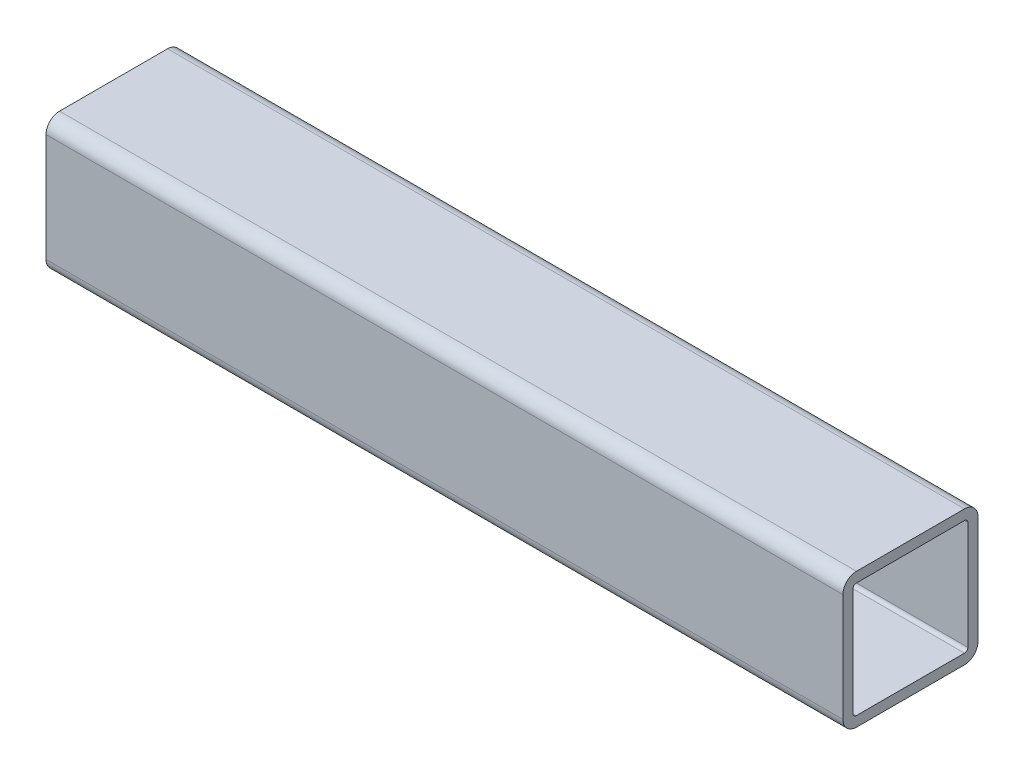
ISO-10303-21;
HEADER;
FILE_DESCRIPTION(('STEP AP214'),'2;1');
FILE_NAME('part.step','',(''),(''),'','','');
FILE_SCHEMA(('AUTOMOTIVE_DESIGN { 1 0 10303 214 1 1 1 1 }'));
ENDSEC;
DATA;
#1=APPLICATION_CONTEXT('core data for automotive mechanical design processes');
#2=APPLICATION_PROTOCOL_DEFINITION('international standard','automotive_design',2000,#1);
#3=PRODUCT_CONTEXT('',#1,'mechanical');
#4=PRODUCT('Part','Part','',(#3));
#5=PRODUCT_RELATED_PRODUCT_CATEGORY('part','',(#4));
#6=PRODUCT_DEFINITION_FORMATION('','',#4);
#7=PRODUCT_DEFINITION_CONTEXT('part definition',#1,'design');
#8=PRODUCT_DEFINITION('design','',#6,#7);
#9=PRODUCT_DEFINITION_SHAPE('','',#8);
#10=(LENGTH_UNIT() NAMED_UNIT(*) SI_UNIT(.MILLI.,.METRE.));
#11=(NAMED_UNIT(*) PLANE_ANGLE_UNIT() SI_UNIT($,.RADIAN.));
#12=(NAMED_UNIT(*) SI_UNIT($,.STERADIAN.) SOLID_ANGLE_UNIT());
#13=UNCERTAINTY_MEASURE_WITH_UNIT(LENGTH_MEASURE(1.E-05),#10,'distance_accuracy_value','');
#14=(GEOMETRIC_REPRESENTATION_CONTEXT(3) GLOBAL_UNCERTAINTY_ASSIGNED_CONTEXT((#13)) GLOBAL_UNIT_ASSIGNED_CONTEXT((#10,
#11,#12)) REPRESENTATION_CONTEXT('',''));
#15=CARTESIAN_POINT('',(0.,0.,0.));
#16=DIRECTION('',(0.,0.,1.));
#17=DIRECTION('',(1.,0.,0.));
#18=AXIS2_PLACEMENT_3D('',#15,#16,#17);
#19=CARTESIAN_POINT('',(-59.0000000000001,7.99999999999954,7.99999999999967));
#20=DIRECTION('',(1.,0.,0.));
#21=DIRECTION('',(0.,0.,-0.999999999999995));
#22=AXIS2_PLACEMENT_3D('',#19,#20,#21);
#23=CYLINDRICAL_SURFACE('',#22,2.);
#24=CARTESIAN_POINT('',(59.,8.00000000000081,7.99999999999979));
#25=DIRECTION('',(-1.,0.,0.));
#26=DIRECTION('',(0.,0.,0.999999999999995));
#27=AXIS2_PLACEMENT_3D('',#24,#25,#26);
#28=CIRCLE('',#27,2.);
#29=CARTESIAN_POINT('',(59.,8.00000000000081,9.99999999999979));
#30=VERTEX_POINT('',#29);
#31=CARTESIAN_POINT('',(58.9999999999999,10.0000000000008,7.99999999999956));
#32=VERTEX_POINT('',#31);
#33=EDGE_CURVE('E228',#30,#32,#28,.T.);
#34=ORIENTED_EDGE('',*,*,#33,.T.);
#35=DIRECTION('',(1.,0.,0.));
#36=VECTOR('',#35,1.);
#37=CARTESIAN_POINT('',(-59.,9.99999999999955,7.99999999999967));
#38=LINE('',#37,#36);
#39=CARTESIAN_POINT('',(-59.,9.99999999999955,7.99999999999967));
#40=VERTEX_POINT('',#39);
#41=EDGE_CURVE('E11',#40,#32,#38,.T.);
#42=ORIENTED_EDGE('',*,*,#41,.F.);
#43=CARTESIAN_POINT('',(-59.0000000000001,7.99999999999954,7.99999999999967));
#44=DIRECTION('',(-1.,0.,0.));
#45=DIRECTION('',(0.,0.,0.999999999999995));
#46=AXIS2_PLACEMENT_3D('',#43,#44,#45);
#47=CIRCLE('',#46,2.);
#48=CARTESIAN_POINT('',(-59.,7.99999999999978,9.99999999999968));
#49=VERTEX_POINT('',#48);
#50=EDGE_CURVE('E334',#49,#40,#47,.T.);
#51=ORIENTED_EDGE('',*,*,#50,.F.);
#52=DIRECTION('',(1.,0.,0.));
#53=VECTOR('',#52,1.);
#54=CARTESIAN_POINT('',(-59.,7.99999999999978,9.99999999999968));
#55=LINE('',#54,#53);
#56=EDGE_CURVE('E251',#49,#30,#55,.T.);
#57=ORIENTED_EDGE('',*,*,#56,.T.);
#58=EDGE_LOOP('',(#34,#42,#51,#57));
#59=FACE_BOUND('',#58,.T.);
#60=ADVANCED_FACE('F42',(#59),#23,.T.);
#61=CARTESIAN_POINT('',(-59.,9.99999999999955,7.99999999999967));
#62=DIRECTION('',(0.,-1.,0.));
#63=DIRECTION('',(0.,0.,-0.999999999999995));
#64=AXIS2_PLACEMENT_3D('',#61,#62,#63);
#65=PLANE('',#64);
#66=DIRECTION('',(0.,0.,-0.999999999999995));
#67=VECTOR('',#66,1.);
#68=CARTESIAN_POINT('',(58.9999999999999,10.0000000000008,7.99999999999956));
#69=LINE('',#68,#67);
#70=CARTESIAN_POINT('',(58.9999999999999,10.0000000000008,-8.00000000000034));
#71=VERTEX_POINT('',#70);
#72=EDGE_CURVE('E232',#32,#71,#69,.T.);
#73=ORIENTED_EDGE('',*,*,#72,.T.);
#74=DIRECTION('',(1.,0.,0.));
#75=VECTOR('',#74,1.);
#76=CARTESIAN_POINT('',(-59.,9.99999999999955,-8.00000000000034));
#77=LINE('',#76,#75);
#78=CARTESIAN_POINT('',(-59.,9.99999999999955,-8.00000000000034));
#79=VERTEX_POINT('',#78);
#80=EDGE_CURVE('E53',#79,#71,#77,.T.);
#81=ORIENTED_EDGE('',*,*,#80,.F.);
#82=DIRECTION('',(0.,0.,-0.999999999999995));
#83=VECTOR('',#82,1.);
#84=CARTESIAN_POINT('',(-59.,9.99999999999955,7.99999999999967));
#85=LINE('',#84,#83);
#86=EDGE_CURVE('E337',#40,#79,#85,.T.);
#87=ORIENTED_EDGE('',*,*,#86,.F.);
#88=ORIENTED_EDGE('',*,*,#41,.T.);
#89=EDGE_LOOP('',(#73,#81,#87,#88));
#90=FACE_BOUND('',#89,.T.);
#91=ADVANCED_FACE('F371',(#90),#65,.F.);
#92=CARTESIAN_POINT('',(-58.9999999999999,7.99999999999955,-8.00000000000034));
#93=DIRECTION('',(1.,0.,0.));
#94=DIRECTION('',(0.,0.,-0.999999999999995));
#95=AXIS2_PLACEMENT_3D('',#92,#93,#94);
#96=CYLINDRICAL_SURFACE('',#95,2.);
#97=CARTESIAN_POINT('',(58.9999999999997,8.0000000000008,-8.00000000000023));
#98=DIRECTION('',(-1.,0.,0.));
#99=DIRECTION('',(0.,0.,0.999999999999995));
#100=AXIS2_PLACEMENT_3D('',#97,#98,#99);
#101=CIRCLE('',#100,2.);
#102=CARTESIAN_POINT('',(58.9999999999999,8.0000000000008,-10.0000000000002));
#103=VERTEX_POINT('',#102);
#104=EDGE_CURVE('E235',#71,#103,#101,.T.);
#105=ORIENTED_EDGE('',*,*,#104,.T.);
#106=DIRECTION('',(1.,0.,0.));
#107=VECTOR('',#106,1.);
#108=CARTESIAN_POINT('',(-59.0000000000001,7.99999999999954,-10.0000000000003));
#109=LINE('',#108,#107);
#110=CARTESIAN_POINT('',(-59.0000000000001,7.99999999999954,-10.0000000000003));
#111=VERTEX_POINT('',#110);
#112=EDGE_CURVE('E262',#111,#103,#109,.T.);
#113=ORIENTED_EDGE('',*,*,#112,.F.);
#114=CARTESIAN_POINT('',(-58.9999999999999,7.99999999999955,-8.00000000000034));
#115=DIRECTION('',(-1.,0.,0.));
#116=DIRECTION('',(0.,0.,0.999999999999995));
#117=AXIS2_PLACEMENT_3D('',#114,#115,#116);
#118=CIRCLE('',#117,2.);
#119=EDGE_CURVE('E340',#79,#111,#118,.T.);
#120=ORIENTED_EDGE('',*,*,#119,.F.);
#121=ORIENTED_EDGE('',*,*,#80,.T.);
#122=EDGE_LOOP('',(#105,#113,#120,#121));
#123=FACE_BOUND('',#122,.T.);
#124=ADVANCED_FACE('F377',(#123),#96,.T.);
#125=CARTESIAN_POINT('',(-59.0000000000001,-8.00000000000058,-10.000000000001));
#126=DIRECTION('',(0.,0.,0.999999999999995));
#127=DIRECTION('',(1.,0.,0.));
#128=AXIS2_PLACEMENT_3D('',#125,#126,#127);
#129=PLANE('',#128);
#130=DIRECTION('',(0.,-1.,0.));
#131=VECTOR('',#130,1.);
#132=CARTESIAN_POINT('',(58.9999999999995,-7.99999999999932,-10.0000000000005));
#133=LINE('',#132,#131);
#134=CARTESIAN_POINT('',(58.9999999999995,-7.99999999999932,-10.0000000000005));
#135=VERTEX_POINT('',#134);
#136=EDGE_CURVE('E238',#103,#135,#133,.T.);
#137=ORIENTED_EDGE('',*,*,#136,.T.);
#138=DIRECTION('',(1.,0.,0.));
#139=VECTOR('',#138,1.);
#140=CARTESIAN_POINT('',(-59.0000000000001,-8.00000000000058,-10.000000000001));
#141=LINE('',#140,#139);
#142=CARTESIAN_POINT('',(-59.0000000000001,-8.00000000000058,-10.000000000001));
#143=VERTEX_POINT('',#142);
#144=EDGE_CURVE('E258',#143,#135,#141,.T.);
#145=ORIENTED_EDGE('',*,*,#144,.F.);
#146=DIRECTION('',(0.,-1.,0.));
#147=VECTOR('',#146,1.);
#148=CARTESIAN_POINT('',(-59.0000000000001,-8.00000000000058,-10.000000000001));
#149=LINE('',#148,#147);
#150=EDGE_CURVE('E343',#111,#143,#149,.T.);
#151=ORIENTED_EDGE('',*,*,#150,.F.);
#152=ORIENTED_EDGE('',*,*,#112,.T.);
#153=EDGE_LOOP('',(#137,#145,#151,#152));
#154=FACE_BOUND('',#153,.T.);
#155=ADVANCED_FACE('F502',(#154),#129,.F.);
#156=CARTESIAN_POINT('',(-59.,-8.00000000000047,-8.00000000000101));
#157=DIRECTION('',(1.,0.,0.));
#158=DIRECTION('',(0.,0.,-0.999999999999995));
#159=AXIS2_PLACEMENT_3D('',#156,#157,#158);
#160=CYLINDRICAL_SURFACE('',#159,2.);
#161=CARTESIAN_POINT('',(58.9999999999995,-7.99999999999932,-8.00000000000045));
#162=DIRECTION('',(-1.,0.,0.));
#163=DIRECTION('',(0.,0.,0.999999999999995));
#164=AXIS2_PLACEMENT_3D('',#161,#162,#163);
#165=CIRCLE('',#164,2.);
#166=CARTESIAN_POINT('',(58.9999999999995,-9.99999999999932,-8.00000000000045));
#167=VERTEX_POINT('',#166);
#168=EDGE_CURVE('E241',#135,#167,#165,.T.);
#169=ORIENTED_EDGE('',*,*,#168,.T.);
#170=DIRECTION('',(1.,0.,0.));
#171=VECTOR('',#170,1.);
#172=CARTESIAN_POINT('',(-59.,-10.0000000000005,-8.00000000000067));
#173=LINE('',#172,#171);
#174=CARTESIAN_POINT('',(-59.,-10.0000000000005,-8.00000000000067));
#175=VERTEX_POINT('',#174);
#176=EDGE_CURVE('E184',#175,#167,#173,.T.);
#177=ORIENTED_EDGE('',*,*,#176,.F.);
#178=CARTESIAN_POINT('',(-59.,-8.00000000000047,-8.00000000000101));
#179=DIRECTION('',(-1.,0.,0.));
#180=DIRECTION('',(0.,0.,0.999999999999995));
#181=AXIS2_PLACEMENT_3D('',#178,#179,#180);
#182=CIRCLE('',#181,2.);
#183=EDGE_CURVE('E173',#143,#175,#182,.T.);
#184=ORIENTED_EDGE('',*,*,#183,.F.);
#185=ORIENTED_EDGE('',*,*,#144,.T.);
#186=EDGE_LOOP('',(#169,#177,#184,#185));
#187=FACE_BOUND('',#186,.T.);
#188=ADVANCED_FACE('F492',(#187),#160,.T.);
#189=CARTESIAN_POINT('',(-59.,-10.0000000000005,-8.00000000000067));
#190=DIRECTION('',(0.,1.,0.));
#191=DIRECTION('',(0.,0.,0.999999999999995));
#192=AXIS2_PLACEMENT_3D('',#189,#190,#191);
#193=PLANE('',#192);
#194=DIRECTION('',(0.,0.,0.999999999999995));
#195=VECTOR('',#194,1.);
#196=CARTESIAN_POINT('',(58.9999999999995,-9.99999999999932,-8.00000000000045));
#197=LINE('',#196,#195);
#198=CARTESIAN_POINT('',(58.9999999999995,-9.99999999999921,7.99999999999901));
#199=VERTEX_POINT('',#198);
#200=EDGE_CURVE('E182',#167,#199,#197,.T.);
#201=ORIENTED_EDGE('',*,*,#200,.T.);
#202=DIRECTION('',(1.,0.,0.));
#203=VECTOR('',#202,1.);
#204=CARTESIAN_POINT('',(-58.9999999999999,-10.0000000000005,7.99999999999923));
#205=LINE('',#204,#203);
#206=CARTESIAN_POINT('',(-58.9999999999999,-10.0000000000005,7.99999999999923));
#207=VERTEX_POINT('',#206);
#208=EDGE_CURVE('E179',#207,#199,#205,.T.);
#209=ORIENTED_EDGE('',*,*,#208,.F.);
#210=DIRECTION('',(0.,0.,0.999999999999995));
#211=VECTOR('',#210,1.);
#212=CARTESIAN_POINT('',(-59.,-10.0000000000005,-8.00000000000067));
#213=LINE('',#212,#211);
#214=EDGE_CURVE('E167',#175,#207,#213,.T.);
#215=ORIENTED_EDGE('',*,*,#214,.F.);
#216=ORIENTED_EDGE('',*,*,#176,.T.);
#217=EDGE_LOOP('',(#201,#209,#215,#216));
#218=FACE_BOUND('',#217,.T.);
#219=ADVANCED_FACE('F180',(#218),#193,.F.);
#220=CARTESIAN_POINT('',(-59.0000000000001,-8.00000000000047,7.99999999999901));
#221=DIRECTION('',(1.,0.,0.));
#222=DIRECTION('',(0.,0.,-0.999999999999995));
#223=AXIS2_PLACEMENT_3D('',#220,#221,#222);
#224=CYLINDRICAL_SURFACE('',#223,2.);
#225=CARTESIAN_POINT('',(58.9999999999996,-7.99999999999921,7.99999999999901));
#226=DIRECTION('',(-1.,0.,0.));
#227=DIRECTION('',(0.,0.,0.999999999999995));
#228=AXIS2_PLACEMENT_3D('',#225,#226,#227);
#229=CIRCLE('',#228,2.);
#230=CARTESIAN_POINT('',(58.9999999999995,-7.9999999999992,9.99999999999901));
#231=VERTEX_POINT('',#230);
#232=EDGE_CURVE('E115',#199,#231,#229,.T.);
#233=ORIENTED_EDGE('',*,*,#232,.T.);
#234=DIRECTION('',(1.,0.,0.));
#235=VECTOR('',#234,1.);
#236=CARTESIAN_POINT('',(-59.,-8.00000000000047,9.99999999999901));
#237=LINE('',#236,#235);
#238=CARTESIAN_POINT('',(-59.,-8.00000000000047,9.99999999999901));
#239=VERTEX_POINT('',#238);
#240=EDGE_CURVE('E185',#239,#231,#237,.T.);
#241=ORIENTED_EDGE('',*,*,#240,.F.);
#242=CARTESIAN_POINT('',(-59.0000000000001,-8.00000000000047,7.99999999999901));
#243=DIRECTION('',(-1.,0.,0.));
#244=DIRECTION('',(0.,0.,0.999999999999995));
#245=AXIS2_PLACEMENT_3D('',#242,#243,#244);
#246=CIRCLE('',#245,2.);
#247=EDGE_CURVE('E171',#207,#239,#246,.T.);
#248=ORIENTED_EDGE('',*,*,#247,.F.);
#249=ORIENTED_EDGE('',*,*,#208,.T.);
#250=EDGE_LOOP('',(#233,#241,#248,#249));
#251=FACE_BOUND('',#250,.T.);
#252=ADVANCED_FACE('F187',(#251),#224,.T.);
#253=CARTESIAN_POINT('',(-58.9999999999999,7.99999999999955,-8.00000000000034));
#254=DIRECTION('',(1.,0.,0.));
#255=DIRECTION('',(0.,0.,-0.999999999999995));
#256=AXIS2_PLACEMENT_3D('',#253,#254,#255);
#257=CYLINDRICAL_SURFACE('',#256,0.500000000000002);
#258=CARTESIAN_POINT('',(58.9999999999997,8.0000000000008,-8.00000000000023));
#259=DIRECTION('',(-1.,0.,0.));
#260=DIRECTION('',(0.,0.,0.999999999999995));
#261=AXIS2_PLACEMENT_3D('',#258,#259,#260);
#262=CIRCLE('',#261,0.500000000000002);
#263=CARTESIAN_POINT('',(58.9999999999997,8.50000000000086,-8.00000000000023));
#264=VERTEX_POINT('',#263);
#265=CARTESIAN_POINT('',(58.9999999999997,8.0000000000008,-8.50000000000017));
#266=VERTEX_POINT('',#265);
#267=EDGE_CURVE('E197',#264,#266,#262,.T.);
#268=ORIENTED_EDGE('',*,*,#267,.F.);
#269=DIRECTION('',(1.,0.,0.));
#270=VECTOR('',#269,1.);
#271=CARTESIAN_POINT('',(-58.9999999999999,8.4999999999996,-8.00000000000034));
#272=LINE('',#271,#270);
#273=CARTESIAN_POINT('',(-58.9999999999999,8.4999999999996,-8.00000000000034));
#274=VERTEX_POINT('',#273);
#275=EDGE_CURVE('E46',#274,#264,#272,.T.);
#276=ORIENTED_EDGE('',*,*,#275,.F.);
#277=CARTESIAN_POINT('',(-58.9999999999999,7.99999999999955,-8.00000000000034));
#278=DIRECTION('',(-1.,0.,0.));
#279=DIRECTION('',(0.,0.,0.999999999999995));
#280=AXIS2_PLACEMENT_3D('',#277,#278,#279);
#281=CIRCLE('',#280,0.500000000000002);
#282=CARTESIAN_POINT('',(-58.9999999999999,7.99999999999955,-8.5000000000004));
#283=VERTEX_POINT('',#282);
#284=EDGE_CURVE('E250',#274,#283,#281,.T.);
#285=ORIENTED_EDGE('',*,*,#284,.T.);
#286=DIRECTION('',(1.,0.,0.));
#287=VECTOR('',#286,1.);
#288=CARTESIAN_POINT('',(-58.9999999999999,7.99999999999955,-8.5000000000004));
#289=LINE('',#288,#287);
#290=EDGE_CURVE('E193',#283,#266,#289,.T.);
#291=ORIENTED_EDGE('',*,*,#290,.T.);
#292=EDGE_LOOP('',(#268,#276,#285,#291));
#293=FACE_BOUND('',#292,.T.);
#294=ADVANCED_FACE('F44',(#293),#257,.F.);
#295=CARTESIAN_POINT('',(-59.0000000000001,8.4999999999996,7.99999999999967));
#296=DIRECTION('',(0.,-1.,0.));
#297=DIRECTION('',(0.,0.,-0.999999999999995));
#298=AXIS2_PLACEMENT_3D('',#295,#296,#297);
#299=PLANE('',#298);
#300=DIRECTION('',(0.,0.,-0.999999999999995));
#301=VECTOR('',#300,1.);
#302=CARTESIAN_POINT('',(59.,8.50000000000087,7.99999999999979));
#303=LINE('',#302,#301);
#304=CARTESIAN_POINT('',(59.,8.50000000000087,7.99999999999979));
#305=VERTEX_POINT('',#304);
#306=EDGE_CURVE('E201',#305,#264,#303,.T.);
#307=ORIENTED_EDGE('',*,*,#306,.F.);
#308=DIRECTION('',(1.,0.,0.));
#309=VECTOR('',#308,1.);
#310=CARTESIAN_POINT('',(-59.0000000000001,8.4999999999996,7.99999999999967));
#311=LINE('',#310,#309);
#312=CARTESIAN_POINT('',(-59.0000000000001,8.4999999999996,7.99999999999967));
#313=VERTEX_POINT('',#312);
#314=EDGE_CURVE('E285',#313,#305,#311,.T.);
#315=ORIENTED_EDGE('',*,*,#314,.F.);
#316=DIRECTION('',(0.,0.,-0.999999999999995));
#317=VECTOR('',#316,1.);
#318=CARTESIAN_POINT('',(-59.0000000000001,8.4999999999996,7.99999999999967));
#319=LINE('',#318,#317);
#320=EDGE_CURVE('E298',#313,#274,#319,.T.);
#321=ORIENTED_EDGE('',*,*,#320,.T.);
#322=ORIENTED_EDGE('',*,*,#275,.T.);
#323=EDGE_LOOP('',(#307,#315,#321,#322));
#324=FACE_BOUND('',#323,.T.);
#325=ADVANCED_FACE('F296',(#324),#299,.T.);
#326=CARTESIAN_POINT('',(-59.0000000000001,7.99999999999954,7.99999999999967));
#327=DIRECTION('',(1.,0.,0.));
#328=DIRECTION('',(0.,0.,-0.999999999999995));
#329=AXIS2_PLACEMENT_3D('',#326,#327,#328);
#330=CYLINDRICAL_SURFACE('',#329,0.500000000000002);
#331=CARTESIAN_POINT('',(59.,8.00000000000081,7.99999999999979));
#332=DIRECTION('',(-1.,0.,0.));
#333=DIRECTION('',(0.,0.,0.999999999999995));
#334=AXIS2_PLACEMENT_3D('',#331,#332,#333);
#335=CIRCLE('',#334,0.500000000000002);
#336=CARTESIAN_POINT('',(59.0000000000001,8.00000000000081,8.49999999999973));
#337=VERTEX_POINT('',#336);
#338=EDGE_CURVE('E205',#337,#305,#335,.T.);
#339=ORIENTED_EDGE('',*,*,#338,.F.);
#340=DIRECTION('',(1.,0.,0.));
#341=VECTOR('',#340,1.);
#342=CARTESIAN_POINT('',(-59.0000000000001,7.99999999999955,8.49999999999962));
#343=LINE('',#342,#341);
#344=CARTESIAN_POINT('',(-59.0000000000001,7.99999999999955,8.49999999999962));
#345=VERTEX_POINT('',#344);
#346=EDGE_CURVE('E283',#345,#337,#343,.T.);
#347=ORIENTED_EDGE('',*,*,#346,.F.);
#348=CARTESIAN_POINT('',(-59.0000000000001,7.99999999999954,7.99999999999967));
#349=DIRECTION('',(-1.,0.,0.));
#350=DIRECTION('',(0.,0.,0.999999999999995));
#351=AXIS2_PLACEMENT_3D('',#348,#349,#350);
#352=CIRCLE('',#351,0.500000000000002);
#353=EDGE_CURVE('E306',#345,#313,#352,.T.);
#354=ORIENTED_EDGE('',*,*,#353,.T.);
#355=ORIENTED_EDGE('',*,*,#314,.T.);
#356=EDGE_LOOP('',(#339,#347,#354,#355));
#357=FACE_BOUND('',#356,.T.);
#358=ADVANCED_FACE('F304',(#357),#330,.F.);
#359=CARTESIAN_POINT('',(-59.0000000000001,7.99999999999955,8.49999999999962));
#360=DIRECTION('',(0.,0.,-0.999999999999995));
#361=DIRECTION('',(-1.,0.,0.));
#362=AXIS2_PLACEMENT_3D('',#359,#360,#361);
#363=PLANE('',#362);
#364=DIRECTION('',(0.,1.,0.));
#365=VECTOR('',#364,1.);
#366=CARTESIAN_POINT('',(59.0000000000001,8.00000000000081,8.49999999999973));
#367=LINE('',#366,#365);
#368=CARTESIAN_POINT('',(58.9999999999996,-7.9999999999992,8.49999999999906));
#369=VERTEX_POINT('',#368);
#370=EDGE_CURVE('E209',#369,#337,#367,.T.);
#371=ORIENTED_EDGE('',*,*,#370,.F.);
#372=DIRECTION('',(1.,0.,0.));
#373=VECTOR('',#372,1.);
#374=CARTESIAN_POINT('',(-59.,-8.00000000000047,8.49999999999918));
#375=LINE('',#374,#373);
#376=CARTESIAN_POINT('',(-59.,-8.00000000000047,8.49999999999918));
#377=VERTEX_POINT('',#376);
#378=EDGE_CURVE('E280',#377,#369,#375,.T.);
#379=ORIENTED_EDGE('',*,*,#378,.F.);
#380=DIRECTION('',(0.,1.,0.));
#381=VECTOR('',#380,1.);
#382=CARTESIAN_POINT('',(-59.0000000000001,7.99999999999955,8.49999999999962));
#383=LINE('',#382,#381);
#384=EDGE_CURVE('E312',#377,#345,#383,.T.);
#385=ORIENTED_EDGE('',*,*,#384,.T.);
#386=ORIENTED_EDGE('',*,*,#346,.T.);
#387=EDGE_LOOP('',(#371,#379,#385,#386));
#388=FACE_BOUND('',#387,.T.);
#389=ADVANCED_FACE('F316',(#388),#363,.T.);
#390=CARTESIAN_POINT('',(-59.0000000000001,-8.00000000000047,7.99999999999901));
#391=DIRECTION('',(1.,0.,0.));
#392=DIRECTION('',(0.,0.,-0.999999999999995));
#393=AXIS2_PLACEMENT_3D('',#390,#391,#392);
#394=CYLINDRICAL_SURFACE('',#393,0.500000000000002);
#395=CARTESIAN_POINT('',(58.9999999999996,-7.99999999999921,7.99999999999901));
#396=DIRECTION('',(-1.,0.,0.));
#397=DIRECTION('',(0.,0.,0.999999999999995));
#398=AXIS2_PLACEMENT_3D('',#395,#396,#397);
#399=CIRCLE('',#398,0.500000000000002);
#400=CARTESIAN_POINT('',(58.9999999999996,-8.49999999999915,7.99999999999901));
#401=VERTEX_POINT('',#400);
#402=EDGE_CURVE('E212',#401,#369,#399,.T.);
#403=ORIENTED_EDGE('',*,*,#402,.F.);
#404=DIRECTION('',(1.,0.,0.));
#405=VECTOR('',#404,1.);
#406=CARTESIAN_POINT('',(-59.,-8.50000000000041,7.99999999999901));
#407=LINE('',#406,#405);
#408=CARTESIAN_POINT('',(-59.,-8.50000000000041,7.99999999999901));
#409=VERTEX_POINT('',#408);
#410=EDGE_CURVE('E277',#409,#401,#407,.T.);
#411=ORIENTED_EDGE('',*,*,#410,.F.);
#412=CARTESIAN_POINT('',(-59.0000000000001,-8.00000000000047,7.99999999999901));
#413=DIRECTION('',(-1.,0.,0.));
#414=DIRECTION('',(0.,0.,0.999999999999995));
#415=AXIS2_PLACEMENT_3D('',#412,#413,#414);
#416=CIRCLE('',#415,0.500000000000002);
#417=EDGE_CURVE('E317',#409,#377,#416,.T.);
#418=ORIENTED_EDGE('',*,*,#417,.T.);
#419=ORIENTED_EDGE('',*,*,#378,.T.);
#420=EDGE_LOOP('',(#403,#411,#418,#419));
#421=FACE_BOUND('',#420,.T.);
#422=ADVANCED_FACE('F361',(#421),#394,.F.);
#423=CARTESIAN_POINT('',(-59.,-8.50000000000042,-8.00000000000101));
#424=DIRECTION('',(0.,1.,0.));
#425=DIRECTION('',(0.,0.,0.999999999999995));
#426=AXIS2_PLACEMENT_3D('',#423,#424,#425);
#427=PLANE('',#426);
#428=DIRECTION('',(0.,0.,0.999999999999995));
#429=VECTOR('',#428,1.);
#430=CARTESIAN_POINT('',(58.9999999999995,-8.49999999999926,-8.00000000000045));
#431=LINE('',#430,#429);
#432=CARTESIAN_POINT('',(58.9999999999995,-8.49999999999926,-8.00000000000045));
#433=VERTEX_POINT('',#432);
#434=EDGE_CURVE('E216',#433,#401,#431,.T.);
#435=ORIENTED_EDGE('',*,*,#434,.F.);
#436=DIRECTION('',(1.,0.,0.));
#437=VECTOR('',#436,1.);
#438=CARTESIAN_POINT('',(-59.,-8.50000000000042,-8.00000000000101));
#439=LINE('',#438,#437);
#440=CARTESIAN_POINT('',(-59.,-8.50000000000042,-8.00000000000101));
#441=VERTEX_POINT('',#440);
#442=EDGE_CURVE('E274',#441,#433,#439,.T.);
#443=ORIENTED_EDGE('',*,*,#442,.F.);
#444=DIRECTION('',(0.,0.,0.999999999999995));
#445=VECTOR('',#444,1.);
#446=CARTESIAN_POINT('',(-59.,-8.50000000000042,-8.00000000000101));
#447=LINE('',#446,#445);
#448=EDGE_CURVE('E320',#441,#409,#447,.T.);
#449=ORIENTED_EDGE('',*,*,#448,.T.);
#450=ORIENTED_EDGE('',*,*,#410,.T.);
#451=EDGE_LOOP('',(#435,#443,#449,#450));
#452=FACE_BOUND('',#451,.T.);
#453=ADVANCED_FACE('F358',(#452),#427,.T.);
#454=CARTESIAN_POINT('',(-59.,-8.00000000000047,-8.00000000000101));
#455=DIRECTION('',(1.,0.,0.));
#456=DIRECTION('',(0.,0.,-0.999999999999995));
#457=AXIS2_PLACEMENT_3D('',#454,#455,#456);
#458=CYLINDRICAL_SURFACE('',#457,0.500000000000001);
#459=CARTESIAN_POINT('',(58.9999999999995,-7.99999999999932,-8.00000000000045));
#460=DIRECTION('',(-1.,0.,0.));
#461=DIRECTION('',(0.,0.,0.999999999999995));
#462=AXIS2_PLACEMENT_3D('',#459,#460,#461);
#463=CIRCLE('',#462,0.500000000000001);
#464=CARTESIAN_POINT('',(58.9999999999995,-7.99999999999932,-8.50000000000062));
#465=VERTEX_POINT('',#464);
#466=EDGE_CURVE('E220',#465,#433,#463,.T.);
#467=ORIENTED_EDGE('',*,*,#466,.F.);
#468=DIRECTION('',(1.,0.,0.));
#469=VECTOR('',#468,1.);
#470=CARTESIAN_POINT('',(-59.,-8.00000000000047,-8.50000000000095));
#471=LINE('',#470,#469);
#472=CARTESIAN_POINT('',(-59.,-8.00000000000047,-8.50000000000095));
#473=VERTEX_POINT('',#472);
#474=EDGE_CURVE('E271',#473,#465,#471,.T.);
#475=ORIENTED_EDGE('',*,*,#474,.F.);
#476=CARTESIAN_POINT('',(-59.,-8.00000000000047,-8.00000000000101));
#477=DIRECTION('',(-1.,0.,0.));
#478=DIRECTION('',(0.,0.,0.999999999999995));
#479=AXIS2_PLACEMENT_3D('',#476,#477,#478);
#480=CIRCLE('',#479,0.500000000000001);
#481=EDGE_CURVE('E326',#473,#441,#480,.T.);
#482=ORIENTED_EDGE('',*,*,#481,.T.);
#483=ORIENTED_EDGE('',*,*,#442,.T.);
#484=EDGE_LOOP('',(#467,#475,#482,#483));
#485=FACE_BOUND('',#484,.T.);
#486=ADVANCED_FACE('F356',(#485),#458,.F.);
#487=CARTESIAN_POINT('',(-59.,-8.00000000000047,-8.50000000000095));
#488=DIRECTION('',(0.,0.,0.999999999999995));
#489=DIRECTION('',(1.,0.,0.));
#490=AXIS2_PLACEMENT_3D('',#487,#488,#489);
#491=PLANE('',#490);
#492=DIRECTION('',(0.,-1.,0.));
#493=VECTOR('',#492,1.);
#494=CARTESIAN_POINT('',(58.9999999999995,-7.99999999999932,-8.50000000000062));
#495=LINE('',#494,#493);
#496=EDGE_CURVE('E224',#266,#465,#495,.T.);
#497=ORIENTED_EDGE('',*,*,#496,.F.);
#498=ORIENTED_EDGE('',*,*,#290,.F.);
#499=DIRECTION('',(0.,-1.,0.));
#500=VECTOR('',#499,1.);
#501=CARTESIAN_POINT('',(-59.,-8.00000000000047,-8.50000000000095));
#502=LINE('',#501,#500);
#503=EDGE_CURVE('E330',#283,#473,#502,.T.);
#504=ORIENTED_EDGE('',*,*,#503,.T.);
#505=ORIENTED_EDGE('',*,*,#474,.T.);
#506=EDGE_LOOP('',(#497,#498,#504,#505));
#507=FACE_BOUND('',#506,.T.);
#508=ADVANCED_FACE('F352',(#507),#491,.T.);
#509=CARTESIAN_POINT('',(-59.,7.99999999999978,9.99999999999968));
#510=DIRECTION('',(0.,0.,-0.999999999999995));
#511=DIRECTION('',(-1.,0.,0.));
#512=AXIS2_PLACEMENT_3D('',#509,#510,#511);
#513=PLANE('',#512);
#514=DIRECTION('',(0.,1.,0.));
#515=VECTOR('',#514,1.);
#516=CARTESIAN_POINT('',(59.,8.00000000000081,9.99999999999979));
#517=LINE('',#516,#515);
#518=EDGE_CURVE('E121',#231,#30,#517,.T.);
#519=ORIENTED_EDGE('',*,*,#518,.T.);
#520=ORIENTED_EDGE('',*,*,#56,.F.);
#521=DIRECTION('',(0.,1.,0.));
#522=VECTOR('',#521,1.);
#523=CARTESIAN_POINT('',(-59.,7.99999999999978,9.99999999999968));
#524=LINE('',#523,#522);
#525=EDGE_CURVE('E62',#239,#49,#524,.T.);
#526=ORIENTED_EDGE('',*,*,#525,.F.);
#527=ORIENTED_EDGE('',*,*,#240,.T.);
#528=EDGE_LOOP('',(#519,#520,#526,#527));
#529=FACE_BOUND('',#528,.T.);
#530=ADVANCED_FACE('F384',(#529),#513,.F.);
#531=CARTESIAN_POINT('',(-59.0000000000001,7.99999999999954,7.99999999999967));
#532=DIRECTION('',(-1.,0.,0.));
#533=DIRECTION('',(0.,0.,0.999999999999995));
#534=AXIS2_PLACEMENT_3D('',#531,#532,#533);
#535=PLANE('',#534);
#536=ORIENTED_EDGE('',*,*,#284,.F.);
#537=ORIENTED_EDGE('',*,*,#320,.F.);
#538=ORIENTED_EDGE('',*,*,#353,.F.);
#539=ORIENTED_EDGE('',*,*,#384,.F.);
#540=ORIENTED_EDGE('',*,*,#417,.F.);
#541=ORIENTED_EDGE('',*,*,#448,.F.);
#542=ORIENTED_EDGE('',*,*,#481,.F.);
#543=ORIENTED_EDGE('',*,*,#503,.F.);
#544=EDGE_LOOP('',(#536,#537,#538,#539,#540,#541,#542,#543));
#545=FACE_BOUND('',#544,.T.);
#546=ORIENTED_EDGE('',*,*,#50,.T.);
#547=ORIENTED_EDGE('',*,*,#86,.T.);
#548=ORIENTED_EDGE('',*,*,#119,.T.);
#549=ORIENTED_EDGE('',*,*,#150,.T.);
#550=ORIENTED_EDGE('',*,*,#183,.T.);
#551=ORIENTED_EDGE('',*,*,#214,.T.);
#552=ORIENTED_EDGE('',*,*,#247,.T.);
#553=ORIENTED_EDGE('',*,*,#525,.T.);
#554=EDGE_LOOP('',(#546,#547,#548,#549,#550,#551,#552,#553));
#555=FACE_BOUND('',#554,.T.);
#556=ADVANCED_FACE('F169',(#545,#555),#535,.T.);
#557=CARTESIAN_POINT('',(59.,8.00000000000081,7.99999999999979));
#558=DIRECTION('',(-1.,0.,0.));
#559=DIRECTION('',(0.,0.,0.999999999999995));
#560=AXIS2_PLACEMENT_3D('',#557,#558,#559);
#561=PLANE('',#560);
#562=ORIENTED_EDGE('',*,*,#267,.T.);
#563=ORIENTED_EDGE('',*,*,#496,.T.);
#564=ORIENTED_EDGE('',*,*,#466,.T.);
#565=ORIENTED_EDGE('',*,*,#434,.T.);
#566=ORIENTED_EDGE('',*,*,#402,.T.);
#567=ORIENTED_EDGE('',*,*,#370,.T.);
#568=ORIENTED_EDGE('',*,*,#338,.T.);
#569=ORIENTED_EDGE('',*,*,#306,.T.);
#570=EDGE_LOOP('',(#562,#563,#564,#565,#566,#567,#568,#569));
#571=FACE_BOUND('',#570,.T.);
#572=ORIENTED_EDGE('',*,*,#33,.F.);
#573=ORIENTED_EDGE('',*,*,#518,.F.);
#574=ORIENTED_EDGE('',*,*,#232,.F.);
#575=ORIENTED_EDGE('',*,*,#200,.F.);
#576=ORIENTED_EDGE('',*,*,#168,.F.);
#577=ORIENTED_EDGE('',*,*,#136,.F.);
#578=ORIENTED_EDGE('',*,*,#104,.F.);
#579=ORIENTED_EDGE('',*,*,#72,.F.);
#580=EDGE_LOOP('',(#572,#573,#574,#575,#576,#577,#578,#579));
#581=FACE_BOUND('',#580,.T.);
#582=ADVANCED_FACE('F301',(#571,#581),#561,.F.);
#583=CLOSED_SHELL('',(#60,#91,#124,#155,#188,#219,#252,#294,#325,#358,#389,#422,#453,#486,#508,
#530,#556,#582));
#584=MANIFOLD_SOLID_BREP('B2',#583);
#585=ADVANCED_BREP_SHAPE_REPRESENTATION('',(#18,#584),#14);
#586=SHAPE_DEFINITION_REPRESENTATION(#9,#585);
ENDSEC;
END-ISO-10303-21;
